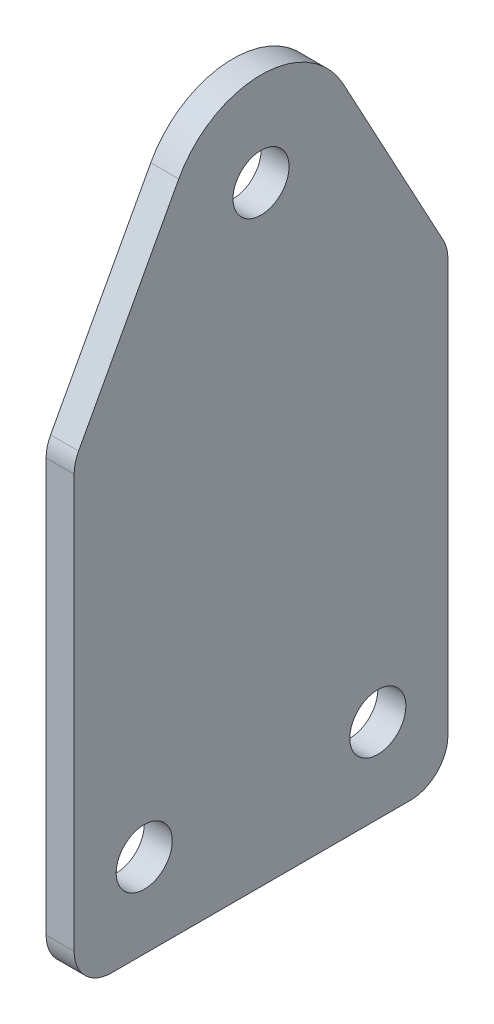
ISO-10303-21;
HEADER;
FILE_DESCRIPTION(('STEP AP214'),'2;1');
FILE_NAME('part.step','',(''),(''),'','','');
FILE_SCHEMA(('AUTOMOTIVE_DESIGN { 1 0 10303 214 1 1 1 1 }'));
ENDSEC;
DATA;
#1=APPLICATION_CONTEXT('core data for automotive mechanical design processes');
#2=APPLICATION_PROTOCOL_DEFINITION('international standard','automotive_design',2000,#1);
#3=PRODUCT_CONTEXT('',#1,'mechanical');
#4=PRODUCT('Part','Part','',(#3));
#5=PRODUCT_RELATED_PRODUCT_CATEGORY('part','',(#4));
#6=PRODUCT_DEFINITION_FORMATION('','',#4);
#7=PRODUCT_DEFINITION_CONTEXT('part definition',#1,'design');
#8=PRODUCT_DEFINITION('design','',#6,#7);
#9=PRODUCT_DEFINITION_SHAPE('','',#8);
#10=(LENGTH_UNIT() NAMED_UNIT(*) SI_UNIT(.MILLI.,.METRE.));
#11=(NAMED_UNIT(*) PLANE_ANGLE_UNIT() SI_UNIT($,.RADIAN.));
#12=(NAMED_UNIT(*) SI_UNIT($,.STERADIAN.) SOLID_ANGLE_UNIT());
#13=UNCERTAINTY_MEASURE_WITH_UNIT(LENGTH_MEASURE(1.E-05),#10,'distance_accuracy_value','');
#14=(GEOMETRIC_REPRESENTATION_CONTEXT(3) GLOBAL_UNCERTAINTY_ASSIGNED_CONTEXT((#13)) GLOBAL_UNIT_ASSIGNED_CONTEXT((#10,
#11,#12)) REPRESENTATION_CONTEXT('',''));
#15=CARTESIAN_POINT('',(0.,0.,0.));
#16=DIRECTION('',(0.,0.,1.));
#17=DIRECTION('',(1.,0.,0.));
#18=AXIS2_PLACEMENT_3D('',#15,#16,#17);
#19=CARTESIAN_POINT('',(-1.49999999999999,-8.11991118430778,10.));
#20=DIRECTION('',(0.,0.,-1.));
#21=DIRECTION('',(1.,0.,0.));
#22=AXIS2_PLACEMENT_3D('',#19,#20,#21);
#23=PLANE('',#22);
#24=DIRECTION('',(0.,1.,0.));
#25=VECTOR('',#24,1.);
#26=CARTESIAN_POINT('',(-1.49999999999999,-8.11991118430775,10.));
#27=LINE('',#26,#25);
#28=CARTESIAN_POINT('',(-1.50000000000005,-16.6199111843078,9.99999999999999));
#29=VERTEX_POINT('',#28);
#30=CARTESIAN_POINT('',(-1.5,5.49468985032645,10.));
#31=VERTEX_POINT('',#30);
#32=EDGE_CURVE('E241',#29,#31,#27,.T.);
#33=ORIENTED_EDGE('',*,*,#32,.F.);
#34=DIRECTION('',(1.,0.,0.));
#35=VECTOR('',#34,1.);
#36=CARTESIAN_POINT('',(-1.50000000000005,-16.6199111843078,9.99999999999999));
#37=LINE('',#36,#35);
#38=CARTESIAN_POINT('',(0.,-16.6199111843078,9.99999999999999));
#39=VERTEX_POINT('',#38);
#40=EDGE_CURVE('E13',#29,#39,#37,.T.);
#41=ORIENTED_EDGE('',*,*,#40,.T.);
#42=DIRECTION('',(0.,-1.,0.));
#43=VECTOR('',#42,1.);
#44=CARTESIAN_POINT('',(0.,-8.11991118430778,10.));
#45=LINE('',#44,#43);
#46=CARTESIAN_POINT('',(0.,5.49468985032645,10.));
#47=VERTEX_POINT('',#46);
#48=EDGE_CURVE('E147',#39,#47,#45,.F.);
#49=ORIENTED_EDGE('',*,*,#48,.T.);
#50=DIRECTION('',(1.,0.,0.));
#51=VECTOR('',#50,1.);
#52=CARTESIAN_POINT('',(-1.5,5.49468985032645,10.));
#53=LINE('',#52,#51);
#54=EDGE_CURVE('E150',#47,#31,#53,.F.);
#55=ORIENTED_EDGE('',*,*,#54,.T.);
#56=EDGE_LOOP('',(#33,#41,#49,#55));
#57=FACE_BOUND('',#56,.T.);
#58=ADVANCED_FACE('F67',(#57),#23,.F.);
#59=CARTESIAN_POINT('',(-1.50000000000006,-18.6199111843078,-10.));
#60=DIRECTION('',(0.,0.,1.));
#61=DIRECTION('',(-1.,0.,0.));
#62=AXIS2_PLACEMENT_3D('',#59,#60,#61);
#63=PLANE('',#62);
#64=DIRECTION('',(0.,1.,0.));
#65=VECTOR('',#64,1.);
#66=CARTESIAN_POINT('',(0.,-18.6199111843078,-10.));
#67=LINE('',#66,#65);
#68=CARTESIAN_POINT('',(0.,5.49468985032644,-10.));
#69=VERTEX_POINT('',#68);
#70=CARTESIAN_POINT('',(0.,-16.6199111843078,-10.));
#71=VERTEX_POINT('',#70);
#72=EDGE_CURVE('E155',#69,#71,#67,.F.);
#73=ORIENTED_EDGE('',*,*,#72,.T.);
#74=DIRECTION('',(1.,0.,0.));
#75=VECTOR('',#74,1.);
#76=CARTESIAN_POINT('',(-1.50000000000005,-16.6199111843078,-10.));
#77=LINE('',#76,#75);
#78=CARTESIAN_POINT('',(-1.50000000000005,-16.6199111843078,-10.));
#79=VERTEX_POINT('',#78);
#80=EDGE_CURVE('E91',#71,#79,#77,.F.);
#81=ORIENTED_EDGE('',*,*,#80,.T.);
#82=DIRECTION('',(0.,-1.,0.));
#83=VECTOR('',#82,1.);
#84=CARTESIAN_POINT('',(-1.49999999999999,-8.11991118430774,-10.));
#85=LINE('',#84,#83);
#86=CARTESIAN_POINT('',(-1.5,5.49468985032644,-10.));
#87=VERTEX_POINT('',#86);
#88=EDGE_CURVE('E238',#87,#79,#85,.T.);
#89=ORIENTED_EDGE('',*,*,#88,.F.);
#90=DIRECTION('',(1.,0.,0.));
#91=VECTOR('',#90,1.);
#92=CARTESIAN_POINT('',(-1.5,5.49468985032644,-10.));
#93=LINE('',#92,#91);
#94=EDGE_CURVE('E169',#87,#69,#93,.T.);
#95=ORIENTED_EDGE('',*,*,#94,.T.);
#96=EDGE_LOOP('',(#73,#81,#89,#95));
#97=FACE_BOUND('',#96,.T.);
#98=ADVANCED_FACE('F278',(#97),#63,.F.);
#99=CARTESIAN_POINT('',(-1.49999999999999,-8.11991118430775,0.));
#100=DIRECTION('',(1.,0.,0.));
#101=DIRECTION('',(0.,1.,0.));
#102=AXIS2_PLACEMENT_3D('',#99,#100,#101);
#103=PLANE('',#102);
#104=CARTESIAN_POINT('',(-1.50000000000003,-14.1199111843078,-6.25000000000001));
#105=DIRECTION('',(1.,0.,0.));
#106=DIRECTION('',(0.,1.,0.));
#107=AXIS2_PLACEMENT_3D('',#104,#105,#106);
#108=CIRCLE('',#107,1.5);
#109=CARTESIAN_POINT('',(-1.50000000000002,-12.6199111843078,-6.25000000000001));
#110=VERTEX_POINT('',#109);
#111=EDGE_CURVE('E156',#110,#110,#108,.F.);
#112=ORIENTED_EDGE('',*,*,#111,.F.);
#113=EDGE_LOOP('',(#112));
#114=FACE_BOUND('',#113,.T.);
#115=CARTESIAN_POINT('',(-1.50000000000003,-14.1199111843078,6.24999999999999));
#116=DIRECTION('',(1.,0.,0.));
#117=DIRECTION('',(0.,1.,0.));
#118=AXIS2_PLACEMENT_3D('',#115,#116,#117);
#119=CIRCLE('',#118,1.5);
#120=CARTESIAN_POINT('',(-1.50000000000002,-12.6199111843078,6.24999999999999));
#121=VERTEX_POINT('',#120);
#122=EDGE_CURVE('E227',#121,#121,#119,.F.);
#123=ORIENTED_EDGE('',*,*,#122,.F.);
#124=EDGE_LOOP('',(#123));
#125=FACE_BOUND('',#124,.T.);
#126=ORIENTED_EDGE('',*,*,#88,.T.);
#127=CARTESIAN_POINT('',(-1.50000000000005,-16.6199111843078,-8.00000000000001));
#128=DIRECTION('',(1.,0.,0.));
#129=DIRECTION('',(0.,1.,0.));
#130=AXIS2_PLACEMENT_3D('',#127,#128,#129);
#131=CIRCLE('',#130,2.);
#132=CARTESIAN_POINT('',(-1.50000000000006,-18.6199111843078,-8.00000000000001));
#133=VERTEX_POINT('',#132);
#134=EDGE_CURVE('E76',#79,#133,#131,.F.);
#135=ORIENTED_EDGE('',*,*,#134,.T.);
#136=DIRECTION('',(0.,0.,1.));
#137=VECTOR('',#136,1.);
#138=CARTESIAN_POINT('',(-1.50000000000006,-18.6199111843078,0.));
#139=LINE('',#138,#137);
#140=CARTESIAN_POINT('',(-1.50000000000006,-18.6199111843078,7.99999999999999));
#141=VERTEX_POINT('',#140);
#142=EDGE_CURVE('E234',#133,#141,#139,.T.);
#143=ORIENTED_EDGE('',*,*,#142,.T.);
#144=CARTESIAN_POINT('',(-1.50000000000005,-16.6199111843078,7.99999999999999));
#145=DIRECTION('',(1.,0.,0.));
#146=DIRECTION('',(0.,1.,0.));
#147=AXIS2_PLACEMENT_3D('',#144,#145,#146);
#148=CIRCLE('',#147,2.);
#149=EDGE_CURVE('E83',#141,#29,#148,.F.);
#150=ORIENTED_EDGE('',*,*,#149,.T.);
#151=ORIENTED_EDGE('',*,*,#32,.T.);
#152=CARTESIAN_POINT('',(-1.5,5.49468985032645,8.));
#153=DIRECTION('',(-1.,0.,0.));
#154=DIRECTION('',(0.,0.,1.));
#155=AXIS2_PLACEMENT_3D('',#152,#153,#154);
#156=CIRCLE('',#155,2.);
#157=CARTESIAN_POINT('',(-1.5,6.44466864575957,9.7599830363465));
#158=VERTEX_POINT('',#157);
#159=EDGE_CURVE('E172',#31,#158,#156,.T.);
#160=ORIENTED_EDGE('',*,*,#159,.T.);
#161=DIRECTION('',(0.,-0.879991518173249,0.474989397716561));
#162=VECTOR('',#161,1.);
#163=CARTESIAN_POINT('',(-1.5,5.99999999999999,10.));
#164=LINE('',#163,#162);
#165=CARTESIAN_POINT('',(-1.5,16.3749469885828,4.39995759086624));
#166=VERTEX_POINT('',#165);
#167=EDGE_CURVE('E208',#166,#158,#164,.T.);
#168=ORIENTED_EDGE('',*,*,#167,.F.);
#169=CARTESIAN_POINT('',(-1.5,14.,0.));
#170=DIRECTION('',(1.,0.,0.));
#171=DIRECTION('',(0.,0.,1.));
#172=AXIS2_PLACEMENT_3D('',#169,#170,#171);
#173=CIRCLE('',#172,5.);
#174=CARTESIAN_POINT('',(-1.5,16.3749469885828,-4.39995759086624));
#175=VERTEX_POINT('',#174);
#176=EDGE_CURVE('E215',#175,#166,#173,.T.);
#177=ORIENTED_EDGE('',*,*,#176,.F.);
#178=DIRECTION('',(0.,0.879991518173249,0.474989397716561));
#179=VECTOR('',#178,1.);
#180=CARTESIAN_POINT('',(-1.5,16.3749469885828,-4.39995759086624));
#181=LINE('',#180,#179);
#182=CARTESIAN_POINT('',(-1.5,6.44466864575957,-9.7599830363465));
#183=VERTEX_POINT('',#182);
#184=EDGE_CURVE('E199',#183,#175,#181,.T.);
#185=ORIENTED_EDGE('',*,*,#184,.F.);
#186=CARTESIAN_POINT('',(-1.5,5.49468985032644,-8.));
#187=DIRECTION('',(-1.,0.,0.));
#188=DIRECTION('',(0.,0.,1.));
#189=AXIS2_PLACEMENT_3D('',#186,#187,#188);
#190=CIRCLE('',#189,2.);
#191=EDGE_CURVE('E180',#183,#87,#190,.T.);
#192=ORIENTED_EDGE('',*,*,#191,.T.);
#193=EDGE_LOOP('',(#126,#135,#143,#150,#151,#160,#168,#177,#185,#192));
#194=FACE_BOUND('',#193,.T.);
#195=CARTESIAN_POINT('',(-1.5,14.,0.));
#196=DIRECTION('',(1.,0.,0.));
#197=DIRECTION('',(0.,0.,-1.));
#198=AXIS2_PLACEMENT_3D('',#195,#196,#197);
#199=CIRCLE('',#198,1.5);
#200=CARTESIAN_POINT('',(-1.5,14.,-1.5));
#201=VERTEX_POINT('',#200);
#202=EDGE_CURVE('E187',#201,#201,#199,.T.);
#203=ORIENTED_EDGE('',*,*,#202,.T.);
#204=EDGE_LOOP('',(#203));
#205=FACE_BOUND('',#204,.T.);
#206=ADVANCED_FACE('F268',(#114,#125,#194,#205),#103,.F.);
#207=CARTESIAN_POINT('',(0.,14.,0.));
#208=DIRECTION('',(-1.,0.,0.));
#209=DIRECTION('',(0.,0.,1.));
#210=AXIS2_PLACEMENT_3D('',#207,#208,#209);
#211=PLANE('',#210);
#212=CARTESIAN_POINT('',(0.,-14.1199111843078,-6.25000000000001));
#213=DIRECTION('',(1.,0.,0.));
#214=DIRECTION('',(0.,1.,0.));
#215=AXIS2_PLACEMENT_3D('',#212,#213,#214);
#216=CIRCLE('',#215,1.5);
#217=CARTESIAN_POINT('',(0.,-12.6199111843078,-6.25000000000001));
#218=VERTEX_POINT('',#217);
#219=EDGE_CURVE('E219',#218,#218,#216,.T.);
#220=ORIENTED_EDGE('',*,*,#219,.F.);
#221=EDGE_LOOP('',(#220));
#222=FACE_BOUND('',#221,.T.);
#223=CARTESIAN_POINT('',(0.,-14.1199111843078,6.24999999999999));
#224=DIRECTION('',(1.,0.,0.));
#225=DIRECTION('',(0.,1.,0.));
#226=AXIS2_PLACEMENT_3D('',#223,#224,#225);
#227=CIRCLE('',#226,1.5);
#228=CARTESIAN_POINT('',(0.,-12.6199111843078,6.24999999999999));
#229=VERTEX_POINT('',#228);
#230=EDGE_CURVE('E223',#229,#229,#227,.T.);
#231=ORIENTED_EDGE('',*,*,#230,.F.);
#232=EDGE_LOOP('',(#231));
#233=FACE_BOUND('',#232,.T.);
#234=DIRECTION('',(0.,0.,-1.));
#235=VECTOR('',#234,1.);
#236=CARTESIAN_POINT('',(0.,-18.6199111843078,9.99999999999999));
#237=LINE('',#236,#235);
#238=CARTESIAN_POINT('',(0.,-18.6199111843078,-8.00000000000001));
#239=VERTEX_POINT('',#238);
#240=CARTESIAN_POINT('',(0.,-18.6199111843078,7.99999999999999));
#241=VERTEX_POINT('',#240);
#242=EDGE_CURVE('E244',#239,#241,#237,.F.);
#243=ORIENTED_EDGE('',*,*,#242,.F.);
#244=CARTESIAN_POINT('',(0.,-16.6199111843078,-8.00000000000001));
#245=DIRECTION('',(1.,0.,0.));
#246=DIRECTION('',(0.,1.,0.));
#247=AXIS2_PLACEMENT_3D('',#244,#245,#246);
#248=CIRCLE('',#247,2.);
#249=EDGE_CURVE('E259',#239,#71,#248,.T.);
#250=ORIENTED_EDGE('',*,*,#249,.T.);
#251=ORIENTED_EDGE('',*,*,#72,.F.);
#252=CARTESIAN_POINT('',(0.,5.49468985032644,-8.));
#253=DIRECTION('',(-1.,0.,0.));
#254=DIRECTION('',(0.,0.,1.));
#255=AXIS2_PLACEMENT_3D('',#252,#253,#254);
#256=CIRCLE('',#255,2.);
#257=CARTESIAN_POINT('',(0.,6.44466864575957,-9.7599830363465));
#258=VERTEX_POINT('',#257);
#259=EDGE_CURVE('E174',#69,#258,#256,.F.);
#260=ORIENTED_EDGE('',*,*,#259,.T.);
#261=DIRECTION('',(0.,0.879991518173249,0.474989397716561));
#262=VECTOR('',#261,1.);
#263=CARTESIAN_POINT('',(0.,16.3749469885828,-4.39995759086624));
#264=LINE('',#263,#262);
#265=CARTESIAN_POINT('',(0.,16.3749469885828,-4.39995759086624));
#266=VERTEX_POINT('',#265);
#267=EDGE_CURVE('E178',#258,#266,#264,.T.);
#268=ORIENTED_EDGE('',*,*,#267,.T.);
#269=CARTESIAN_POINT('',(0.,14.,0.));
#270=DIRECTION('',(1.,0.,0.));
#271=DIRECTION('',(0.,0.,1.));
#272=AXIS2_PLACEMENT_3D('',#269,#270,#271);
#273=CIRCLE('',#272,5.);
#274=CARTESIAN_POINT('',(0.,16.3749469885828,4.39995759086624));
#275=VERTEX_POINT('',#274);
#276=EDGE_CURVE('E287',#266,#275,#273,.T.);
#277=ORIENTED_EDGE('',*,*,#276,.T.);
#278=DIRECTION('',(0.,-0.879991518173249,0.474989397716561));
#279=VECTOR('',#278,1.);
#280=CARTESIAN_POINT('',(0.,5.99999999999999,10.));
#281=LINE('',#280,#279);
#282=CARTESIAN_POINT('',(0.,6.44466864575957,9.7599830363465));
#283=VERTEX_POINT('',#282);
#284=EDGE_CURVE('E164',#275,#283,#281,.T.);
#285=ORIENTED_EDGE('',*,*,#284,.T.);
#286=CARTESIAN_POINT('',(0.,5.49468985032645,8.));
#287=DIRECTION('',(-1.,0.,0.));
#288=DIRECTION('',(0.,0.,1.));
#289=AXIS2_PLACEMENT_3D('',#286,#287,#288);
#290=CIRCLE('',#289,2.);
#291=EDGE_CURVE('E159',#283,#47,#290,.F.);
#292=ORIENTED_EDGE('',*,*,#291,.T.);
#293=ORIENTED_EDGE('',*,*,#48,.F.);
#294=CARTESIAN_POINT('',(0.,-16.6199111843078,7.99999999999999));
#295=DIRECTION('',(1.,0.,0.));
#296=DIRECTION('',(0.,1.,0.));
#297=AXIS2_PLACEMENT_3D('',#294,#295,#296);
#298=CIRCLE('',#297,2.);
#299=EDGE_CURVE('E256',#39,#241,#298,.T.);
#300=ORIENTED_EDGE('',*,*,#299,.T.);
#301=EDGE_LOOP('',(#243,#250,#251,#260,#268,#277,#285,#292,#293,#300));
#302=FACE_BOUND('',#301,.T.);
#303=CARTESIAN_POINT('',(0.,14.,0.));
#304=DIRECTION('',(1.,0.,0.));
#305=DIRECTION('',(0.,0.,-1.));
#306=AXIS2_PLACEMENT_3D('',#303,#304,#305);
#307=CIRCLE('',#306,1.5);
#308=CARTESIAN_POINT('',(0.,14.,-1.5));
#309=VERTEX_POINT('',#308);
#310=EDGE_CURVE('E191',#309,#309,#307,.T.);
#311=ORIENTED_EDGE('',*,*,#310,.F.);
#312=EDGE_LOOP('',(#311));
#313=FACE_BOUND('',#312,.T.);
#314=ADVANCED_FACE('F69',(#222,#233,#302,#313),#211,.F.);
#315=CARTESIAN_POINT('',(-1.50000000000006,-18.6199111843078,9.99999999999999));
#316=DIRECTION('',(0.,1.,0.));
#317=DIRECTION('',(-1.,0.,0.));
#318=AXIS2_PLACEMENT_3D('',#315,#316,#317);
#319=PLANE('',#318);
#320=ORIENTED_EDGE('',*,*,#142,.F.);
#321=DIRECTION('',(1.,0.,0.));
#322=VECTOR('',#321,1.);
#323=CARTESIAN_POINT('',(-1.50000000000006,-18.6199111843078,-8.00000000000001));
#324=LINE('',#323,#322);
#325=EDGE_CURVE('E252',#133,#239,#324,.T.);
#326=ORIENTED_EDGE('',*,*,#325,.T.);
#327=ORIENTED_EDGE('',*,*,#242,.T.);
#328=DIRECTION('',(1.,0.,0.));
#329=VECTOR('',#328,1.);
#330=CARTESIAN_POINT('',(-1.50000000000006,-18.6199111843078,7.99999999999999));
#331=LINE('',#330,#329);
#332=EDGE_CURVE('E237',#241,#141,#331,.F.);
#333=ORIENTED_EDGE('',*,*,#332,.T.);
#334=EDGE_LOOP('',(#320,#326,#327,#333));
#335=FACE_BOUND('',#334,.T.);
#336=ADVANCED_FACE('F273',(#335),#319,.F.);
#337=CARTESIAN_POINT('',(-1.50100000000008,-14.1199111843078,6.24999999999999));
#338=DIRECTION('',(1.,0.,0.));
#339=DIRECTION('',(0.,1.,0.));
#340=AXIS2_PLACEMENT_3D('',#337,#338,#339);
#341=CYLINDRICAL_SURFACE('',#340,1.5);
#342=ORIENTED_EDGE('',*,*,#230,.T.);
#343=EDGE_LOOP('',(#342));
#344=FACE_BOUND('',#343,.T.);
#345=ORIENTED_EDGE('',*,*,#122,.T.);
#346=EDGE_LOOP('',(#345));
#347=FACE_BOUND('',#346,.T.);
#348=ADVANCED_FACE('F323',(#344,#347),#341,.F.);
#349=CARTESIAN_POINT('',(-1.50100000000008,-14.1199111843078,-6.25000000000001));
#350=DIRECTION('',(1.,0.,0.));
#351=DIRECTION('',(0.,1.,0.));
#352=AXIS2_PLACEMENT_3D('',#349,#350,#351);
#353=CYLINDRICAL_SURFACE('',#352,1.5);
#354=ORIENTED_EDGE('',*,*,#219,.T.);
#355=EDGE_LOOP('',(#354));
#356=FACE_BOUND('',#355,.T.);
#357=ORIENTED_EDGE('',*,*,#111,.T.);
#358=EDGE_LOOP('',(#357));
#359=FACE_BOUND('',#358,.T.);
#360=ADVANCED_FACE('F311',(#356,#359),#353,.F.);
#361=CARTESIAN_POINT('',(-1.50000000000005,-16.6199111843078,-8.00000000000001));
#362=DIRECTION('',(1.,0.,0.));
#363=DIRECTION('',(0.,1.,0.));
#364=AXIS2_PLACEMENT_3D('',#361,#362,#363);
#365=CYLINDRICAL_SURFACE('',#364,2.);
#366=ORIENTED_EDGE('',*,*,#134,.F.);
#367=ORIENTED_EDGE('',*,*,#80,.F.);
#368=ORIENTED_EDGE('',*,*,#249,.F.);
#369=ORIENTED_EDGE('',*,*,#325,.F.);
#370=EDGE_LOOP('',(#366,#367,#368,#369));
#371=FACE_BOUND('',#370,.T.);
#372=ADVANCED_FACE('F275',(#371),#365,.T.);
#373=CARTESIAN_POINT('',(-1.50000000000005,-16.6199111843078,7.99999999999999));
#374=DIRECTION('',(1.,0.,0.));
#375=DIRECTION('',(0.,1.,0.));
#376=AXIS2_PLACEMENT_3D('',#373,#374,#375);
#377=CYLINDRICAL_SURFACE('',#376,2.);
#378=ORIENTED_EDGE('',*,*,#149,.F.);
#379=ORIENTED_EDGE('',*,*,#332,.F.);
#380=ORIENTED_EDGE('',*,*,#299,.F.);
#381=ORIENTED_EDGE('',*,*,#40,.F.);
#382=EDGE_LOOP('',(#378,#379,#380,#381));
#383=FACE_BOUND('',#382,.T.);
#384=ADVANCED_FACE('F304',(#383),#377,.T.);
#385=CARTESIAN_POINT('',(-1.5,14.,0.));
#386=DIRECTION('',(1.,0.,0.));
#387=DIRECTION('',(0.,0.,-1.));
#388=AXIS2_PLACEMENT_3D('',#385,#386,#387);
#389=CYLINDRICAL_SURFACE('',#388,5.);
#390=ORIENTED_EDGE('',*,*,#276,.F.);
#391=DIRECTION('',(1.,0.,0.));
#392=VECTOR('',#391,1.);
#393=CARTESIAN_POINT('',(-1.5,16.3749469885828,-4.39995759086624));
#394=LINE('',#393,#392);
#395=EDGE_CURVE('E195',#175,#266,#394,.T.);
#396=ORIENTED_EDGE('',*,*,#395,.F.);
#397=ORIENTED_EDGE('',*,*,#176,.T.);
#398=DIRECTION('',(1.,0.,0.));
#399=VECTOR('',#398,1.);
#400=CARTESIAN_POINT('',(-1.5,16.3749469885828,4.39995759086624));
#401=LINE('',#400,#399);
#402=EDGE_CURVE('E212',#166,#275,#401,.T.);
#403=ORIENTED_EDGE('',*,*,#402,.T.);
#404=EDGE_LOOP('',(#390,#396,#397,#403));
#405=FACE_BOUND('',#404,.T.);
#406=ADVANCED_FACE('F299',(#405),#389,.T.);
#407=CARTESIAN_POINT('',(-1.5,5.99999999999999,10.));
#408=DIRECTION('',(0.,0.474989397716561,0.879991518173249));
#409=DIRECTION('',(0.,-0.879991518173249,0.474989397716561));
#410=AXIS2_PLACEMENT_3D('',#407,#408,#409);
#411=PLANE('',#410);
#412=ORIENTED_EDGE('',*,*,#167,.T.);
#413=DIRECTION('',(1.,0.,0.));
#414=VECTOR('',#413,1.);
#415=CARTESIAN_POINT('',(-1.5,6.44466864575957,9.7599830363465));
#416=LINE('',#415,#414);
#417=EDGE_CURVE('E205',#158,#283,#416,.T.);
#418=ORIENTED_EDGE('',*,*,#417,.T.);
#419=ORIENTED_EDGE('',*,*,#284,.F.);
#420=ORIENTED_EDGE('',*,*,#402,.F.);
#421=EDGE_LOOP('',(#412,#418,#419,#420));
#422=FACE_BOUND('',#421,.T.);
#423=ADVANCED_FACE('F302',(#422),#411,.T.);
#424=CARTESIAN_POINT('',(-1.5,5.49468985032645,8.));
#425=DIRECTION('',(1.,0.,0.));
#426=DIRECTION('',(0.,0.,-1.));
#427=AXIS2_PLACEMENT_3D('',#424,#425,#426);
#428=CYLINDRICAL_SURFACE('',#427,2.);
#429=ORIENTED_EDGE('',*,*,#159,.F.);
#430=ORIENTED_EDGE('',*,*,#54,.F.);
#431=ORIENTED_EDGE('',*,*,#291,.F.);
#432=ORIENTED_EDGE('',*,*,#417,.F.);
#433=EDGE_LOOP('',(#429,#430,#431,#432));
#434=FACE_BOUND('',#433,.T.);
#435=ADVANCED_FACE('F171',(#434),#428,.T.);
#436=CARTESIAN_POINT('',(-1.5,5.49468985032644,-8.));
#437=DIRECTION('',(1.,0.,0.));
#438=DIRECTION('',(0.,0.,-1.));
#439=AXIS2_PLACEMENT_3D('',#436,#437,#438);
#440=CYLINDRICAL_SURFACE('',#439,2.);
#441=ORIENTED_EDGE('',*,*,#191,.F.);
#442=DIRECTION('',(1.,0.,0.));
#443=VECTOR('',#442,1.);
#444=CARTESIAN_POINT('',(-1.5,6.44466864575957,-9.7599830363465));
#445=LINE('',#444,#443);
#446=EDGE_CURVE('E202',#258,#183,#445,.F.);
#447=ORIENTED_EDGE('',*,*,#446,.F.);
#448=ORIENTED_EDGE('',*,*,#259,.F.);
#449=ORIENTED_EDGE('',*,*,#94,.F.);
#450=EDGE_LOOP('',(#441,#447,#448,#449));
#451=FACE_BOUND('',#450,.T.);
#452=ADVANCED_FACE('F339',(#451),#440,.T.);
#453=CARTESIAN_POINT('',(-1.5,16.3749469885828,-4.39995759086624));
#454=DIRECTION('',(0.,0.474989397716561,-0.879991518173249));
#455=DIRECTION('',(0.,0.879991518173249,0.474989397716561));
#456=AXIS2_PLACEMENT_3D('',#453,#454,#455);
#457=PLANE('',#456);
#458=ORIENTED_EDGE('',*,*,#267,.F.);
#459=ORIENTED_EDGE('',*,*,#446,.T.);
#460=ORIENTED_EDGE('',*,*,#184,.T.);
#461=ORIENTED_EDGE('',*,*,#395,.T.);
#462=EDGE_LOOP('',(#458,#459,#460,#461));
#463=FACE_BOUND('',#462,.T.);
#464=ADVANCED_FACE('F295',(#463),#457,.T.);
#465=CARTESIAN_POINT('',(-1.5,14.,0.));
#466=DIRECTION('',(1.,0.,0.));
#467=DIRECTION('',(0.,0.,-1.));
#468=AXIS2_PLACEMENT_3D('',#465,#466,#467);
#469=CYLINDRICAL_SURFACE('',#468,1.5);
#470=ORIENTED_EDGE('',*,*,#202,.F.);
#471=EDGE_LOOP('',(#470));
#472=FACE_BOUND('',#471,.T.);
#473=ORIENTED_EDGE('',*,*,#310,.T.);
#474=EDGE_LOOP('',(#473));
#475=FACE_BOUND('',#474,.T.);
#476=ADVANCED_FACE('F333',(#472,#475),#469,.F.);
#477=CLOSED_SHELL('',(#58,#98,#206,#314,#336,#348,#360,#372,#384,#406,#423,#435,#452,#464,#476));
#478=MANIFOLD_SOLID_BREP('B2',#477);
#479=ADVANCED_BREP_SHAPE_REPRESENTATION('',(#18,#478),#14);
#480=SHAPE_DEFINITION_REPRESENTATION(#9,#479);
ENDSEC;
END-ISO-10303-21;
